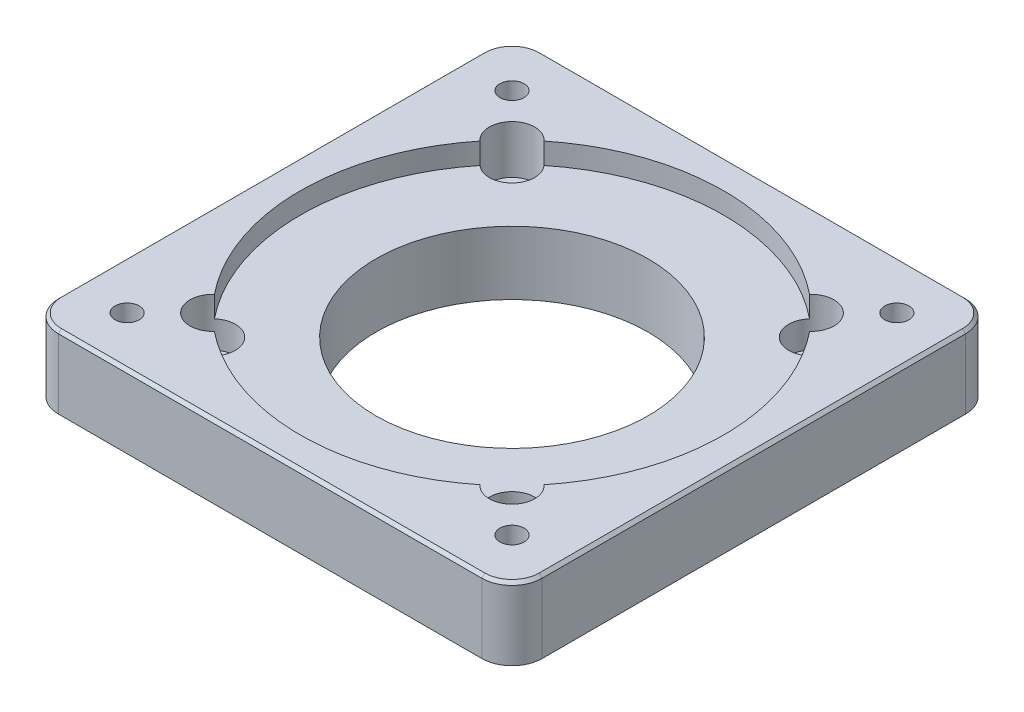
from build123d import *

# Parameters (mm, degrees)
SKETCH_1_W               = 80
SKETCH_1_H               = 80
EXTRUDE_1_DEPTH          = 12
SKETCH_2_R               = 35
CUT_EXTRUDE_1_DEPTH      = 3.5
SKETCH_3_R               = 9
CUT_EXTRUDE_2_DEPTH      = 18
SKETCH_5_R               = 22.5
CUT_EXTRUDE_3_DEPTH      = 48
SKETCH_9_R               = 3.75
CUT_EXTRUDE_4_DEPTH      = 8
SKETCH_15_R              = 2.25
CUT_EXTRUDE_10_DEPTH     = 12
PATTERN_CIRCULAR_1_COUNT = 4
FILLET_1_R               = 5
SKETCH_16_R              = 2
CUT_EXTRUDE_11_DEPTH     = 58.827329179
EXTRUDE_START            = 2
SKETCH_17_R              = 25
SKETCH_17_R_2            = 22.5
EXTRUDE_1_2_DEPTH        = 2
CHAMFER_1_SIZE           = 0.5


with BuildPart() as part:
    # Sketch 1 → Extrude 1 (new body)
    with BuildSketch(Plane(origin=(0, 0, 0), x_dir=(1, 0, 0), z_dir=(0, 1, 0))):
        Rectangle(SKETCH_1_W, SKETCH_1_H)
    extrude(amount=EXTRUDE_1_DEPTH)

    # Sketch 2 → Cut-Extrude 1 (cut)
    with BuildSketch(Plane(origin=(0, 12, 0), x_dir=(1, 0, 0), z_dir=(0, 1, 0))):
        with Locations(Location((0, 0, 0), (0, 0, 270))):
            Circle(SKETCH_2_R)
    extrude(amount=-CUT_EXTRUDE_1_DEPTH, mode=Mode.SUBTRACT)

    # Sketch 3 → Cut-Extrude 2 (cut)
    with BuildSketch(Plane(origin=(0, 8.5, 0), x_dir=(1, 0, 0), z_dir=(0, 1, 0))):
        with Locations(Location((0, 0, 0), (0, 0, 270))):
            Circle(SKETCH_3_R)
    extrude(amount=-CUT_EXTRUDE_2_DEPTH, mode=Mode.SUBTRACT)

    # Sketch 5 → Cut-Extrude 3 (cut)
    with BuildSketch(Plane.XZ):
        with Locations(Location((0, 0, 0), (0, 0, 270))):
            Circle(SKETCH_5_R)
    extrude(amount=-CUT_EXTRUDE_3_DEPTH, mode=Mode.SUBTRACT)

    # Sketch 9 → Cut-Extrude 4 (cut)
    with BuildSketch(Plane(origin=(0, 12, 0), x_dir=(1, 0, 0), z_dir=(0, 1, 0))):
        with Locations(Location((24.748737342, 24.748737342, 0), (0, 0, 270))):
            Circle(SKETCH_9_R)
    cut_extrude_4 = extrude(amount=-CUT_EXTRUDE_4_DEPTH, mode=Mode.SUBTRACT)

    # Sketch 15 → Cut-Extrude 10 (cut)
    with BuildSketch(Plane(origin=(0, 4, 0), x_dir=(1, 0, 0), z_dir=(0, 1, 0))):
        with Locations(Location((24.748737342, 24.748737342, 0), (0, 0, 270))):
            Circle(SKETCH_15_R)
    cut_extrude_10 = extrude(amount=-CUT_EXTRUDE_10_DEPTH, mode=Mode.SUBTRACT)

    # Pattern Circular 1: Cut-Extrude 4, Cut-Extrude 10 ×4 about axis
    pattern_circular_1_axis = Axis((0, 0, 0), (0, 1, 0))
    add([cut_extrude_4.rotate(pattern_circular_1_axis, i * 360 / PATTERN_CIRCULAR_1_COUNT) for i in range(1, PATTERN_CIRCULAR_1_COUNT)], mode=Mode.SUBTRACT)
    add([cut_extrude_10.rotate(pattern_circular_1_axis, i * 360 / PATTERN_CIRCULAR_1_COUNT) for i in range(1, PATTERN_CIRCULAR_1_COUNT)], mode=Mode.SUBTRACT)

    # Fillet 1
    fillet_1_edges = [part.edges().sort_by_distance(p)[0] for p in [
        (-40, 6, -40),
        (40, 6, -40),
        (40, 6, 40),
        (-40, 6, 40),
    ]]
    fillet(fillet_1_edges, radius=FILLET_1_R)

    # Sketch 16 → Cut-Extrude 11 (cut, through all)
    with BuildSketch(Plane(origin=(0, 12, 0), x_dir=(1, 0, 0), z_dir=(0, 1, 0))):
        with Locations(Location((-31.819805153, 31.819805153, 0), (0, 0, 270))):
            Circle(SKETCH_16_R)
        with Locations(Location((31.819805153, 31.819805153, 0), (0, 0, 270))):
            Circle(SKETCH_16_R)
        with Locations(Location((31.819805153, -31.819805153, 0), (0, 0, 270))):
            Circle(SKETCH_16_R)
        with Locations(Location((-31.819805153, -31.819805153, 0), (0, 0, 270))):
            Circle(SKETCH_16_R)
    extrude(amount=-CUT_EXTRUDE_11_DEPTH, mode=Mode.SUBTRACT)

    # Sketch 17 → Extrude 1 2 (add)
    with BuildSketch(Plane.XZ.offset(EXTRUDE_START)):
        Circle(SKETCH_17_R)
        Circle(SKETCH_17_R_2, mode=Mode.SUBTRACT)
    extrude(amount=-EXTRUDE_1_2_DEPTH)

    # Chamfer 1
    chamfer_1_edges = [part.edges().sort_by_distance(p)[0] for p in [
        (40, 12, 0),
        (0, 12, 40),
        (-40, 12, 0),
        (0, 12, -40),
        (-38.535533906, 12, 38.535533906),
        (-38.535533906, 12, -38.535533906),
        (38.535533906, 12, -38.535533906),
        (38.535533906, 12, 38.535533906),
    ]]
    chamfer(chamfer_1_edges, length=CHAMFER_1_SIZE)


solid = part.part
